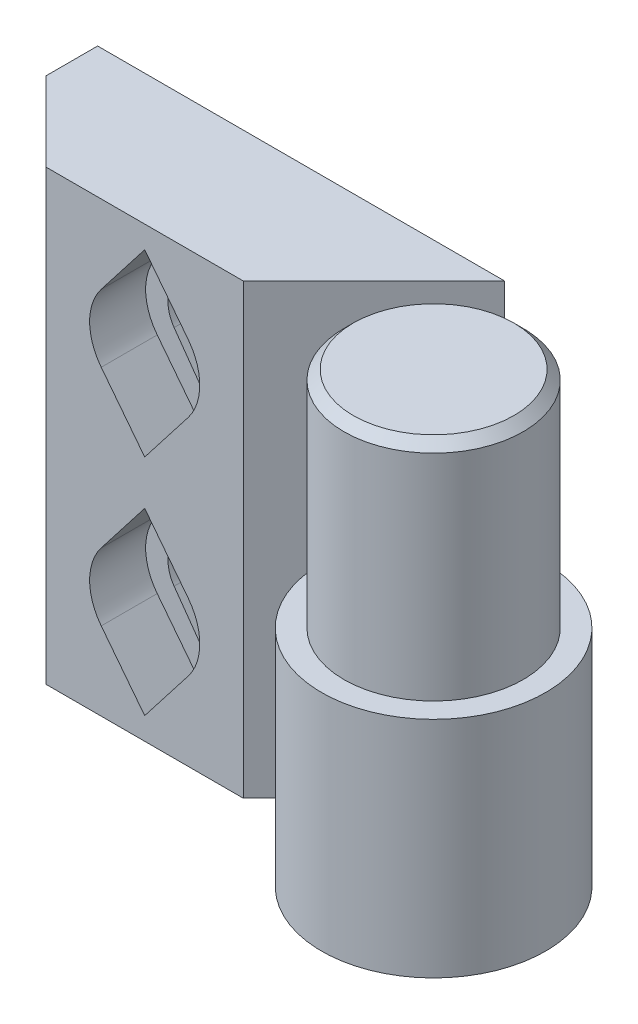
from build123d import *

# Parameters (mm, degrees)
SKETCH1_R           = 6
BOSS_EXTRUDE1_DEPTH = 12
SKETCH2_R           = 4.8
BOSS_EXTRUDE2_DEPTH = 12
CHAMFER1_SIZE       = 0.5
BOSS_EXTRUDE3_DEPTH = 12
BOSS_EXTRUDE4_DEPTH = 12
BOSS_EXTRUDE5_DEPTH = 24
CHAMFER2_SIZE       = 4.24
CUT_EXTRUDE1_DEPTH  = 3
CUT_EXTRUDE2_REACH  = 36.871


with BuildPart() as part:
    # Sketch1 → Boss-Extrude1 (new body)
    with BuildSketch(Plane(origin=(0, 0, 0), x_dir=(1, 0, 0), z_dir=(0, 1, 0))):
        with Locations(Location((0, 0, 0), (0, 0, 270))):
            Circle(SKETCH1_R)
    extrude(amount=BOSS_EXTRUDE1_DEPTH)

    # Sketch2 → Boss-Extrude2 (add)
    with BuildSketch(Plane(origin=(0, 12, 0), x_dir=(1, 0, 0), z_dir=(0, 1, 0))):
        with Locations(Location((0, 0, 0), (0, 0, 270))):
            Circle(SKETCH2_R)
    extrude(amount=BOSS_EXTRUDE2_DEPTH)

    # Chamfer1
    chamfer1_edges = [part.edges().sort_by_distance(p)[0] for p in [
        (0, 24, -4.8),
    ]]
    chamfer(chamfer1_edges, length=CHAMFER1_SIZE)


with BuildPart() as body_2:
    # Sketch3 → Boss-Extrude3 (new body)
    with BuildSketch(Plane(origin=(0, 0, 0), x_dir=(1, 0, 0), z_dir=(0, 1, 0))):
        Polygon((-5.196152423, 3), (0, 6), (-24, 6), (-24, 3), align=None)
    extrude(amount=BOSS_EXTRUDE3_DEPTH)


with BuildPart() as part_1:
    add(part.part)

    # Combine1: union body 2
    add(body_2.part)

    # Sketch4 → Boss-Extrude4 (add)
    with BuildSketch(Plane(origin=(0, 12, 0), x_dir=(1, 0, 0), z_dir=(0, 1, 0))):
        Polygon((-24, 3), (-5.196152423, 3), (-2.196152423, 6), (-24, 6), align=None)
    extrude(amount=BOSS_EXTRUDE4_DEPTH)

    # Sketch5 → Boss-Extrude5 (add)
    with BuildSketch(Plane.XZ):
        Polygon((-5.196152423, -3), (-9.196152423, 1), (-24, 1), (-24, -3), align=None)
    extrude(amount=-BOSS_EXTRUDE5_DEPTH)

    # Chamfer2
    chamfer2_edges = [part_1.edges().sort_by_distance(p)[0] for p in [
        (-24, 12, 1),
    ]]
    chamfer(chamfer2_edges, length=CHAMFER2_SIZE)

    # Sketch6 → Cut-Extrude1 (cut)
    with BuildSketch(Plane.XY.offset(1)):
        with BuildLine():
            Line((-16.807962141, 19.809456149), (-14.478076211, 22.809456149))
            Line((-14.478076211, 22.809456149), (-12.148190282, 19.809456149))
            ThreePointArc((-12.148190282, 19.809456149), (-11.528076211, 18), (-12.148190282, 16.190543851))
            Line((-12.148190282, 16.190543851), (-14.478076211, 13.190543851))
            Line((-14.478076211, 13.190543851), (-16.807962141, 16.190543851))
            ThreePointArc((-16.807962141, 16.190543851), (-17.428076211, 18), (-16.807962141, 19.809456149))
        make_face()
        with BuildLine():
            Line((-14.478076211, 1.190543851), (-12.148190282, 4.190543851))
            ThreePointArc((-12.148190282, 4.190543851), (-11.528076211, 6), (-12.148190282, 7.809456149))
            Line((-12.148190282, 7.809456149), (-14.478076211, 10.809456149))
            Line((-14.478076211, 10.809456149), (-16.807962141, 7.809456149))
            ThreePointArc((-16.807962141, 7.809456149), (-17.428076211, 6), (-16.807962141, 4.190543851))
            Line((-16.807962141, 4.190543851), (-14.478076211, 1.190543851))
        make_face()
    extrude(amount=-CUT_EXTRUDE1_DEPTH, mode=Mode.SUBTRACT)

    # Sketch7 → Cut-Extrude2 (cut, up to next)
    with BuildSketch(Plane.XY.offset(-2), mode=Mode.PRIVATE) as cut_extrude2_sk1:
        with BuildLine():
            Line((-15.903252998, 19.015564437), (-14.478076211, 21.015564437))
            Line((-14.478076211, 21.015564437), (-13.052899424, 19.015564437))
            ThreePointArc((-13.052899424, 19.015564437), (-12.728076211, 18), (-13.052899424, 16.984435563))
            Line((-13.052899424, 16.984435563), (-14.478076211, 14.984435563))
            Line((-14.478076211, 14.984435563), (-15.903252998, 16.984435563))
            ThreePointArc((-15.903252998, 16.984435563), (-16.228076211, 18), (-15.903252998, 19.015564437))
        make_face()
    cut_extrude2_tool1 = extrude(cut_extrude2_sk1.sketch, amount=-CUT_EXTRUDE2_REACH, mode=Mode.PRIVATE) & part_1.part
    # Sketch7 → Cut-Extrude2 (cut, up to next)
    with BuildSketch(Plane.XY.offset(-2), mode=Mode.PRIVATE) as cut_extrude2_sk2:
        with BuildLine():
            Line((-15.903252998, 4.984435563), (-14.478076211, 2.984435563))
            Line((-14.478076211, 2.984435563), (-13.052899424, 4.984435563))
            ThreePointArc((-13.052899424, 4.984435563), (-12.728076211, 6), (-13.052899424, 7.015564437))
            Line((-13.052899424, 7.015564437), (-14.478076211, 9.015564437))
            Line((-14.478076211, 9.015564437), (-15.903252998, 7.015564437))
            ThreePointArc((-15.903252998, 7.015564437), (-16.228076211, 6), (-15.903252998, 4.984435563))
        make_face()
    cut_extrude2_tool2 = extrude(cut_extrude2_sk2.sketch, amount=-CUT_EXTRUDE2_REACH, mode=Mode.PRIVATE) & part_1.part
    add(cut_extrude2_tool1.solids().sort_by_distance((-14.478076, 18, -2))[0], mode=Mode.SUBTRACT)
    add(cut_extrude2_tool2.solids().sort_by_distance((-14.478076, 6, -2))[0], mode=Mode.SUBTRACT)


solid = part_1.part
